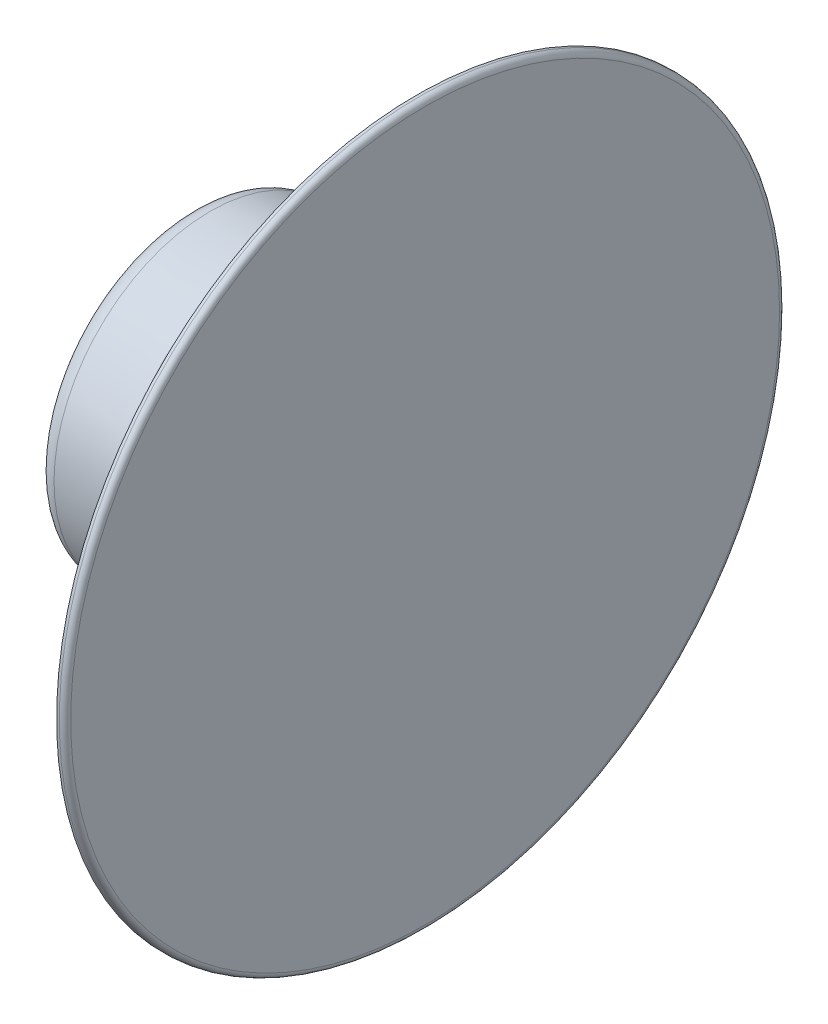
ISO-10303-21;
HEADER;
FILE_DESCRIPTION(('STEP AP214'),'2;1');
FILE_NAME('part.step','',(''),(''),'','','');
FILE_SCHEMA(('AUTOMOTIVE_DESIGN { 1 0 10303 214 1 1 1 1 }'));
ENDSEC;
DATA;
#1=APPLICATION_CONTEXT('core data for automotive mechanical design processes');
#2=APPLICATION_PROTOCOL_DEFINITION('international standard','automotive_design',2000,#1);
#3=PRODUCT_CONTEXT('',#1,'mechanical');
#4=PRODUCT('Part','Part','',(#3));
#5=PRODUCT_RELATED_PRODUCT_CATEGORY('part','',(#4));
#6=PRODUCT_DEFINITION_FORMATION('','',#4);
#7=PRODUCT_DEFINITION_CONTEXT('part definition',#1,'design');
#8=PRODUCT_DEFINITION('design','',#6,#7);
#9=PRODUCT_DEFINITION_SHAPE('','',#8);
#10=(LENGTH_UNIT() NAMED_UNIT(*) SI_UNIT(.MILLI.,.METRE.));
#11=(NAMED_UNIT(*) PLANE_ANGLE_UNIT() SI_UNIT($,.RADIAN.));
#12=(NAMED_UNIT(*) SI_UNIT($,.STERADIAN.) SOLID_ANGLE_UNIT());
#13=UNCERTAINTY_MEASURE_WITH_UNIT(LENGTH_MEASURE(1.E-05),#10,'distance_accuracy_value','');
#14=(GEOMETRIC_REPRESENTATION_CONTEXT(3) GLOBAL_UNCERTAINTY_ASSIGNED_CONTEXT((#13)) GLOBAL_UNIT_ASSIGNED_CONTEXT((#10,
#11,#12)) REPRESENTATION_CONTEXT('',''));
#15=CARTESIAN_POINT('',(0.,0.,0.));
#16=DIRECTION('',(0.,0.,1.));
#17=DIRECTION('',(1.,0.,0.));
#18=AXIS2_PLACEMENT_3D('',#15,#16,#17);
#19=CARTESIAN_POINT('',(0.,0.,0.));
#20=DIRECTION('',(1.,0.,0.));
#21=DIRECTION('',(0.,0.,-1.));
#22=AXIS2_PLACEMENT_3D('',#19,#20,#21);
#23=PLANE('',#22);
#24=CARTESIAN_POINT('',(0.,0.,0.));
#25=DIRECTION('',(1.,0.,0.));
#26=DIRECTION('',(0.,0.,-1.));
#27=AXIS2_PLACEMENT_3D('',#24,#25,#26);
#28=CIRCLE('',#27,15.748);
#29=CARTESIAN_POINT('',(0.,0.,-15.748));
#30=VERTEX_POINT('',#29);
#31=EDGE_CURVE('E22',#30,#30,#28,.T.);
#32=ORIENTED_EDGE('',*,*,#31,.T.);
#33=EDGE_LOOP('',(#32));
#34=FACE_BOUND('',#33,.T.);
#35=ADVANCED_FACE('F14',(#34),#23,.T.);
#36=CARTESIAN_POINT('',(0.,0.,0.));
#37=DIRECTION('',(1.,0.,0.));
#38=DIRECTION('',(0.,0.,-1.));
#39=AXIS2_PLACEMENT_3D('',#36,#37,#38);
#40=CYLINDRICAL_SURFACE('',#39,16.002);
#41=CARTESIAN_POINT('',(-0.254,0.,0.));
#42=DIRECTION('',(1.,0.,0.));
#43=DIRECTION('',(0.,0.,-1.));
#44=AXIS2_PLACEMENT_3D('',#41,#42,#43);
#45=CIRCLE('',#44,16.002);
#46=CARTESIAN_POINT('',(-0.254,0.,-16.002));
#47=VERTEX_POINT('',#46);
#48=EDGE_CURVE('E9',#47,#47,#45,.F.);
#49=ORIENTED_EDGE('',*,*,#48,.T.);
#50=EDGE_LOOP('',(#49));
#51=FACE_BOUND('',#50,.T.);
#52=CARTESIAN_POINT('',(-0.37338,0.,0.));
#53=DIRECTION('',(1.,0.,0.));
#54=DIRECTION('',(0.,0.,-1.));
#55=AXIS2_PLACEMENT_3D('',#52,#53,#54);
#56=CIRCLE('',#55,16.002);
#57=CARTESIAN_POINT('',(-0.37338,0.,-16.002));
#58=VERTEX_POINT('',#57);
#59=EDGE_CURVE('E50',#58,#58,#56,.T.);
#60=ORIENTED_EDGE('',*,*,#59,.T.);
#61=EDGE_LOOP('',(#60));
#62=FACE_BOUND('',#61,.T.);
#63=ADVANCED_FACE('F56',(#51,#62),#40,.T.);
#64=CARTESIAN_POINT('',(-0.37338,0.,0.));
#65=DIRECTION('',(1.,0.,0.));
#66=DIRECTION('',(0.,0.,-1.));
#67=AXIS2_PLACEMENT_3D('',#64,#65,#66);
#68=CONICAL_SURFACE('',#67,16.002,1.05641019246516);
#69=CARTESIAN_POINT('',(-4.81019082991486,0.,0.));
#70=DIRECTION('',(1.,0.,0.));
#71=DIRECTION('',(0.,0.,-1.));
#72=AXIS2_PLACEMENT_3D('',#69,#70,#71);
#73=CIRCLE('',#72,8.15106323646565);
#74=CARTESIAN_POINT('',(-4.81019082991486,0.,-8.15106323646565));
#75=VERTEX_POINT('',#74);
#76=EDGE_CURVE('E36',#75,#75,#73,.T.);
#77=ORIENTED_EDGE('',*,*,#76,.T.);
#78=EDGE_LOOP('',(#77));
#79=FACE_BOUND('',#78,.T.);
#80=ORIENTED_EDGE('',*,*,#59,.F.);
#81=EDGE_LOOP('',(#80));
#82=FACE_BOUND('',#81,.T.);
#83=ADVANCED_FACE('F58',(#79,#82),#68,.T.);
#84=CARTESIAN_POINT('',(-5.45338,0.,0.));
#85=DIRECTION('',(1.,0.,0.));
#86=DIRECTION('',(0.,0.,-1.));
#87=AXIS2_PLACEMENT_3D('',#84,#85,#86);
#88=CONICAL_SURFACE('',#87,7.01294,0.0174532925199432);
#89=CARTESIAN_POINT('',(-6.7604745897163,0.,0.));
#90=DIRECTION('',(1.,0.,0.));
#91=DIRECTION('',(0.,0.,-1.));
#92=AXIS2_PLACEMENT_3D('',#89,#90,#91);
#93=CIRCLE('',#92,6.99012457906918);
#94=CARTESIAN_POINT('',(-6.7604745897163,0.,-6.99012457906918));
#95=VERTEX_POINT('',#94);
#96=EDGE_CURVE('E30',#95,#95,#93,.F.);
#97=ORIENTED_EDGE('',*,*,#96,.T.);
#98=EDGE_LOOP('',(#97));
#99=FACE_BOUND('',#98,.T.);
#100=CARTESIAN_POINT('',(-9.54813518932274,0.,0.));
#101=DIRECTION('',(-1.,0.,0.));
#102=DIRECTION('',(0.,0.,1.));
#103=AXIS2_PLACEMENT_3D('',#100,#101,#102);
#104=CIRCLE('',#103,6.94146578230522);
#105=CARTESIAN_POINT('',(-9.54813518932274,0.,6.94146578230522));
#106=VERTEX_POINT('',#105);
#107=EDGE_CURVE('E46',#106,#106,#104,.F.);
#108=ORIENTED_EDGE('',*,*,#107,.T.);
#109=EDGE_LOOP('',(#108));
#110=FACE_BOUND('',#109,.T.);
#111=ADVANCED_FACE('F60',(#99,#110),#88,.T.);
#112=CARTESIAN_POINT('',(-10.42162,6.92621904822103,0.));
#113=DIRECTION('',(-1.,0.,0.));
#114=DIRECTION('',(0.,0.,1.));
#115=AXIS2_PLACEMENT_3D('',#112,#113,#114);
#116=PLANE('',#115);
#117=CARTESIAN_POINT('',(-10.42162,0.,0.));
#118=DIRECTION('',(-1.,0.,0.));
#119=DIRECTION('',(0.,0.,1.));
#120=AXIS2_PLACEMENT_3D('',#117,#118,#119);
#121=CIRCLE('',#120,6.05260118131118);
#122=CARTESIAN_POINT('',(-10.42162,0.,6.05260118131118));
#123=VERTEX_POINT('',#122);
#124=EDGE_CURVE('E42',#123,#123,#121,.T.);
#125=ORIENTED_EDGE('',*,*,#124,.T.);
#126=EDGE_LOOP('',(#125));
#127=FACE_BOUND('',#126,.T.);
#128=ADVANCED_FACE('F69',(#127),#116,.T.);
#129=CARTESIAN_POINT('',(-9.53262,0.,0.));
#130=DIRECTION('',(-1.,0.,0.));
#131=DIRECTION('',(0.,0.,1.));
#132=AXIS2_PLACEMENT_3D('',#129,#130,#131);
#133=TOROIDAL_SURFACE('',#132,6.05260118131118,0.889);
#134=ORIENTED_EDGE('',*,*,#124,.F.);
#135=EDGE_LOOP('',(#134));
#136=FACE_BOUND('',#135,.T.);
#137=ORIENTED_EDGE('',*,*,#107,.F.);
#138=EDGE_LOOP('',(#137));
#139=FACE_BOUND('',#138,.T.);
#140=ADVANCED_FACE('F79',(#136,#139),#133,.T.);
#141=CARTESIAN_POINT('',(-6.80037079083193,0.,0.));
#142=DIRECTION('',(1.,0.,0.));
#143=DIRECTION('',(0.,0.,-1.));
#144=AXIS2_PLACEMENT_3D('',#141,#142,#143);
#145=TOROIDAL_SURFACE('',#144,9.27577641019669,2.286);
#146=ORIENTED_EDGE('',*,*,#96,.F.);
#147=EDGE_LOOP('',(#146));
#148=FACE_BOUND('',#147,.T.);
#149=ORIENTED_EDGE('',*,*,#76,.F.);
#150=EDGE_LOOP('',(#149));
#151=FACE_BOUND('',#150,.T.);
#152=ADVANCED_FACE('F81',(#148,#151),#145,.F.);
#153=CARTESIAN_POINT('',(-0.254,0.,0.));
#154=DIRECTION('',(1.,0.,0.));
#155=DIRECTION('',(0.,0.,-1.));
#156=AXIS2_PLACEMENT_3D('',#153,#154,#155);
#157=TOROIDAL_SURFACE('',#156,15.748,0.254);
#158=ORIENTED_EDGE('',*,*,#48,.F.);
#159=EDGE_LOOP('',(#158));
#160=FACE_BOUND('',#159,.T.);
#161=ORIENTED_EDGE('',*,*,#31,.F.);
#162=EDGE_LOOP('',(#161));
#163=FACE_BOUND('',#162,.T.);
#164=ADVANCED_FACE('F16',(#160,#163),#157,.T.);
#165=CLOSED_SHELL('',(#35,#63,#83,#111,#128,#140,#152,#164));
#166=MANIFOLD_SOLID_BREP('B1',#165);
#167=ADVANCED_BREP_SHAPE_REPRESENTATION('',(#18,#166),#14);
#168=SHAPE_DEFINITION_REPRESENTATION(#9,#167);
ENDSEC;
END-ISO-10303-21;
